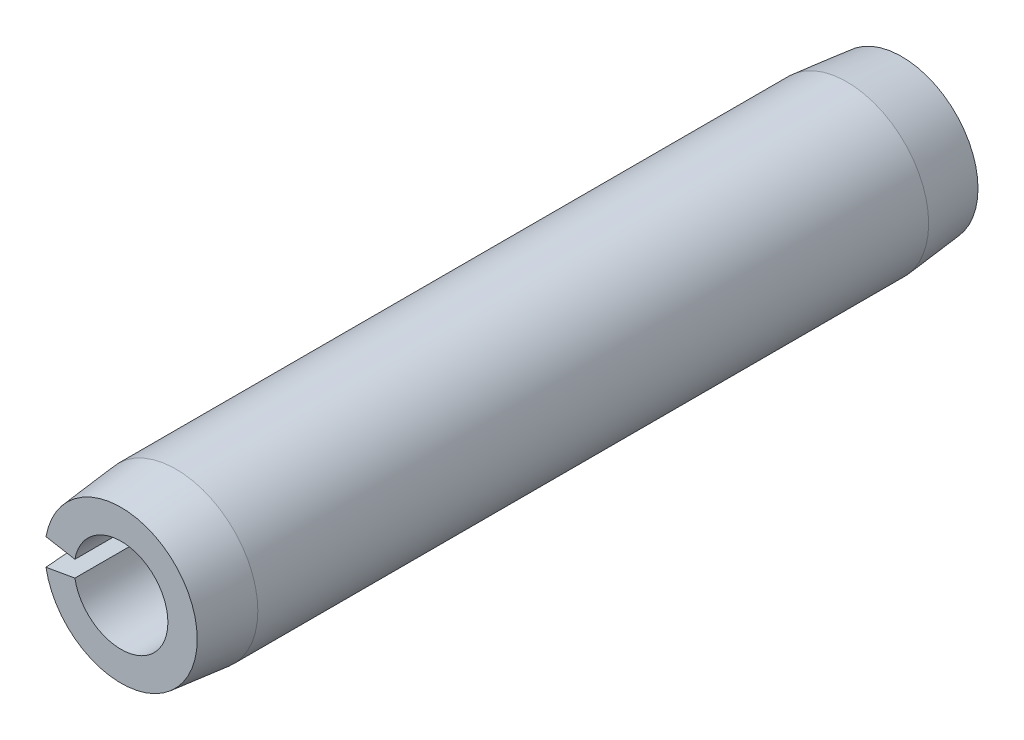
ISO-10303-21;
HEADER;
FILE_DESCRIPTION(('STEP AP214'),'2;1');
FILE_NAME('part.step','',(''),(''),'','','');
FILE_SCHEMA(('AUTOMOTIVE_DESIGN { 1 0 10303 214 1 1 1 1 }'));
ENDSEC;
DATA;
#1=APPLICATION_CONTEXT('core data for automotive mechanical design processes');
#2=APPLICATION_PROTOCOL_DEFINITION('international standard','automotive_design',2000,#1);
#3=PRODUCT_CONTEXT('',#1,'mechanical');
#4=PRODUCT('Part','Part','',(#3));
#5=PRODUCT_RELATED_PRODUCT_CATEGORY('part','',(#4));
#6=PRODUCT_DEFINITION_FORMATION('','',#4);
#7=PRODUCT_DEFINITION_CONTEXT('part definition',#1,'design');
#8=PRODUCT_DEFINITION('design','',#6,#7);
#9=PRODUCT_DEFINITION_SHAPE('','',#8);
#10=(LENGTH_UNIT() NAMED_UNIT(*) SI_UNIT(.MILLI.,.METRE.));
#11=(NAMED_UNIT(*) PLANE_ANGLE_UNIT() SI_UNIT($,.RADIAN.));
#12=(NAMED_UNIT(*) SI_UNIT($,.STERADIAN.) SOLID_ANGLE_UNIT());
#13=UNCERTAINTY_MEASURE_WITH_UNIT(LENGTH_MEASURE(1.E-05),#10,'distance_accuracy_value','');
#14=(GEOMETRIC_REPRESENTATION_CONTEXT(3) GLOBAL_UNCERTAINTY_ASSIGNED_CONTEXT((#13)) GLOBAL_UNIT_ASSIGNED_CONTEXT((#10,
#11,#12)) REPRESENTATION_CONTEXT('',''));
#15=CARTESIAN_POINT('',(0.,0.,0.));
#16=DIRECTION('',(0.,0.,1.));
#17=DIRECTION('',(1.,0.,0.));
#18=AXIS2_PLACEMENT_3D('',#15,#16,#17);
#19=CARTESIAN_POINT('',(0.,0.,7.9375));
#20=DIRECTION('',(0.,0.,-1.));
#21=DIRECTION('',(-1.,0.,0.));
#22=AXIS2_PLACEMENT_3D('',#19,#20,#21);
#23=CYLINDRICAL_SURFACE('',#22,0.9525);
#24=CARTESIAN_POINT('',(0.,0.,-7.9375));
#25=DIRECTION('',(0.,0.,-1.));
#26=DIRECTION('',(1.,0.,0.));
#27=AXIS2_PLACEMENT_3D('',#24,#25,#26);
#28=CIRCLE('',#27,0.9525);
#29=CARTESIAN_POINT('',(-0.938029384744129,0.165399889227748,-7.9375));
#30=VERTEX_POINT('',#29);
#31=CARTESIAN_POINT('',(-0.938029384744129,-0.165399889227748,-7.9375));
#32=VERTEX_POINT('',#31);
#33=EDGE_CURVE('E131',#30,#32,#28,.T.);
#34=ORIENTED_EDGE('',*,*,#33,.T.);
#35=DIRECTION('',(0.,0.,-1.));
#36=VECTOR('',#35,1.);
#37=CARTESIAN_POINT('',(-0.938029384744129,-0.165399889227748,7.9375));
#38=LINE('',#37,#36);
#39=CARTESIAN_POINT('',(-0.938029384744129,-0.165399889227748,7.9375));
#40=VERTEX_POINT('',#39);
#41=EDGE_CURVE('E11',#40,#32,#38,.T.);
#42=ORIENTED_EDGE('',*,*,#41,.F.);
#43=CARTESIAN_POINT('',(0.,0.,7.9375));
#44=DIRECTION('',(0.,0.,-1.));
#45=DIRECTION('',(1.,0.,0.));
#46=AXIS2_PLACEMENT_3D('',#43,#44,#45);
#47=CIRCLE('',#46,0.9525);
#48=CARTESIAN_POINT('',(-0.938029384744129,0.165399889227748,7.9375));
#49=VERTEX_POINT('',#48);
#50=EDGE_CURVE('E126',#49,#40,#47,.T.);
#51=ORIENTED_EDGE('',*,*,#50,.F.);
#52=DIRECTION('',(0.,0.,-1.));
#53=VECTOR('',#52,1.);
#54=CARTESIAN_POINT('',(-0.938029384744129,0.165399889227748,7.9375));
#55=LINE('',#54,#53);
#56=EDGE_CURVE('E115',#49,#30,#55,.T.);
#57=ORIENTED_EDGE('',*,*,#56,.T.);
#58=EDGE_LOOP('',(#34,#42,#51,#57));
#59=FACE_BOUND('',#58,.T.);
#60=ADVANCED_FACE('F39',(#59),#23,.F.);
#61=CARTESIAN_POINT('',(-0.938029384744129,-0.165399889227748,7.9375));
#62=DIRECTION('',(0.173648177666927,-0.984807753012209,0.));
#63=DIRECTION('',(0.984807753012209,0.173648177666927,0.));
#64=AXIS2_PLACEMENT_3D('',#61,#62,#63);
#65=PLANE('',#64);
#66=DIRECTION('',(0.,0.,-1.));
#67=VECTOR('',#66,1.);
#68=CARTESIAN_POINT('',(-1.63842465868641,-0.288898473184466,7.9375));
#69=LINE('',#68,#67);
#70=CARTESIAN_POINT('',(-1.63842465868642,-0.288898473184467,6.8199));
#71=VERTEX_POINT('',#70);
#72=CARTESIAN_POINT('',(-1.63842465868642,-0.288898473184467,-6.8199));
#73=VERTEX_POINT('',#72);
#74=EDGE_CURVE('E47',#71,#73,#69,.T.);
#75=ORIENTED_EDGE('',*,*,#74,.F.);
#76=DIRECTION('',(-0.100196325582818,-0.0176673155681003,-0.99481081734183));
#77=VECTOR('',#76,1.);
#78=CARTESIAN_POINT('',(0.,0.,23.0871888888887));
#79=LINE('',#78,#77);
#80=CARTESIAN_POINT('',(-1.52586113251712,-0.269050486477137,7.9375));
#81=VERTEX_POINT('',#80);
#82=EDGE_CURVE('E94',#71,#81,#79,.F.);
#83=ORIENTED_EDGE('',*,*,#82,.T.);
#84=DIRECTION('',(-0.984807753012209,-0.173648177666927,0.));
#85=VECTOR('',#84,1.);
#86=CARTESIAN_POINT('',(-0.938029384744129,-0.165399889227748,7.9375));
#87=LINE('',#86,#85);
#88=EDGE_CURVE('E137',#40,#81,#87,.T.);
#89=ORIENTED_EDGE('',*,*,#88,.F.);
#90=ORIENTED_EDGE('',*,*,#41,.T.);
#91=DIRECTION('',(-0.984807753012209,-0.173648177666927,0.));
#92=VECTOR('',#91,1.);
#93=CARTESIAN_POINT('',(-0.938029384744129,-0.165399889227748,-7.9375));
#94=LINE('',#93,#92);
#95=CARTESIAN_POINT('',(-1.52586113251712,-0.269050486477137,-7.9375));
#96=VERTEX_POINT('',#95);
#97=EDGE_CURVE('E127',#32,#96,#94,.T.);
#98=ORIENTED_EDGE('',*,*,#97,.T.);
#99=DIRECTION('',(0.100196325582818,0.0176673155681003,-0.99481081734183));
#100=VECTOR('',#99,1.);
#101=CARTESIAN_POINT('',(0.,0.,-23.0871888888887));
#102=LINE('',#101,#100);
#103=EDGE_CURVE('E62',#96,#73,#102,.F.);
#104=ORIENTED_EDGE('',*,*,#103,.T.);
#105=EDGE_LOOP('',(#75,#83,#89,#90,#98,#104));
#106=FACE_BOUND('',#105,.T.);
#107=ADVANCED_FACE('F158',(#106),#65,.F.);
#108=CARTESIAN_POINT('',(0.,0.,7.9375));
#109=DIRECTION('',(0.,0.,-1.));
#110=DIRECTION('',(-1.,0.,0.));
#111=AXIS2_PLACEMENT_3D('',#108,#109,#110);
#112=CYLINDRICAL_SURFACE('',#111,1.6637);
#113=DIRECTION('',(0.,0.,-1.));
#114=VECTOR('',#113,1.);
#115=CARTESIAN_POINT('',(-1.63842465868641,0.288898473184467,7.9375));
#116=LINE('',#115,#114);
#117=CARTESIAN_POINT('',(-1.63842465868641,0.288898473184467,6.8199));
#118=VERTEX_POINT('',#117);
#119=CARTESIAN_POINT('',(-1.63842465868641,0.288898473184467,-6.8199));
#120=VERTEX_POINT('',#119);
#121=EDGE_CURVE('E105',#118,#120,#116,.T.);
#122=ORIENTED_EDGE('',*,*,#121,.F.);
#123=CARTESIAN_POINT('',(0.,0.,6.8199));
#124=DIRECTION('',(0.,0.,-1.));
#125=DIRECTION('',(-1.,0.,0.));
#126=AXIS2_PLACEMENT_3D('',#123,#124,#125);
#127=CIRCLE('',#126,1.6637);
#128=EDGE_CURVE('E91',#118,#71,#127,.T.);
#129=ORIENTED_EDGE('',*,*,#128,.T.);
#130=ORIENTED_EDGE('',*,*,#74,.T.);
#131=CARTESIAN_POINT('',(0.,0.,-6.8199));
#132=DIRECTION('',(0.,0.,-1.));
#133=DIRECTION('',(-1.,0.,0.));
#134=AXIS2_PLACEMENT_3D('',#131,#132,#133);
#135=CIRCLE('',#134,1.6637);
#136=EDGE_CURVE('E113',#120,#73,#135,.T.);
#137=ORIENTED_EDGE('',*,*,#136,.F.);
#138=EDGE_LOOP('',(#122,#129,#130,#137));
#139=FACE_BOUND('',#138,.T.);
#140=ADVANCED_FACE('F112',(#139),#112,.T.);
#141=CARTESIAN_POINT('',(-1.63842465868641,0.288898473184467,7.9375));
#142=DIRECTION('',(0.173648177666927,0.984807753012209,0.));
#143=DIRECTION('',(-0.984807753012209,0.173648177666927,0.));
#144=AXIS2_PLACEMENT_3D('',#141,#142,#143);
#145=PLANE('',#144);
#146=DIRECTION('',(0.984807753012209,-0.173648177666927,0.));
#147=VECTOR('',#146,1.);
#148=CARTESIAN_POINT('',(-1.63842465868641,0.288898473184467,7.9375));
#149=LINE('',#148,#147);
#150=CARTESIAN_POINT('',(-1.52586113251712,0.269050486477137,7.9375));
#151=VERTEX_POINT('',#150);
#152=EDGE_CURVE('E108',#151,#49,#149,.T.);
#153=ORIENTED_EDGE('',*,*,#152,.F.);
#154=DIRECTION('',(0.100196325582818,-0.0176673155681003,0.99481081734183));
#155=VECTOR('',#154,1.);
#156=CARTESIAN_POINT('',(0.,0.,23.0871888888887));
#157=LINE('',#156,#155);
#158=EDGE_CURVE('E54',#151,#118,#157,.F.);
#159=ORIENTED_EDGE('',*,*,#158,.T.);
#160=ORIENTED_EDGE('',*,*,#121,.T.);
#161=DIRECTION('',(-0.100196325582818,0.0176673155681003,0.99481081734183));
#162=VECTOR('',#161,1.);
#163=CARTESIAN_POINT('',(0.,0.,-23.0871888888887));
#164=LINE('',#163,#162);
#165=CARTESIAN_POINT('',(-1.52586113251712,0.269050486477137,-7.9375));
#166=VERTEX_POINT('',#165);
#167=EDGE_CURVE('E145',#120,#166,#164,.F.);
#168=ORIENTED_EDGE('',*,*,#167,.T.);
#169=DIRECTION('',(0.984807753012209,-0.173648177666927,0.));
#170=VECTOR('',#169,1.);
#171=CARTESIAN_POINT('',(-1.63842465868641,0.288898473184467,-7.9375));
#172=LINE('',#171,#170);
#173=EDGE_CURVE('E123',#166,#30,#172,.T.);
#174=ORIENTED_EDGE('',*,*,#173,.T.);
#175=ORIENTED_EDGE('',*,*,#56,.F.);
#176=EDGE_LOOP('',(#153,#159,#160,#168,#174,#175));
#177=FACE_BOUND('',#176,.T.);
#178=ADVANCED_FACE('F103',(#177),#145,.F.);
#179=CARTESIAN_POINT('',(0.,0.,7.9375));
#180=DIRECTION('',(0.,0.,1.));
#181=DIRECTION('',(1.,0.,0.));
#182=AXIS2_PLACEMENT_3D('',#179,#180,#181);
#183=PLANE('',#182);
#184=CARTESIAN_POINT('',(0.,0.,7.9375));
#185=DIRECTION('',(0.,0.,-1.));
#186=DIRECTION('',(-1.,0.,0.));
#187=AXIS2_PLACEMENT_3D('',#184,#185,#186);
#188=CIRCLE('',#187,1.5494);
#189=EDGE_CURVE('E99',#151,#81,#188,.T.);
#190=ORIENTED_EDGE('',*,*,#189,.F.);
#191=ORIENTED_EDGE('',*,*,#152,.T.);
#192=ORIENTED_EDGE('',*,*,#50,.T.);
#193=ORIENTED_EDGE('',*,*,#88,.T.);
#194=EDGE_LOOP('',(#190,#191,#192,#193));
#195=FACE_BOUND('',#194,.T.);
#196=ADVANCED_FACE('F159',(#195),#183,.T.);
#197=CARTESIAN_POINT('',(0.,0.,-7.9375));
#198=DIRECTION('',(0.,0.,1.));
#199=DIRECTION('',(1.,0.,0.));
#200=AXIS2_PLACEMENT_3D('',#197,#198,#199);
#201=PLANE('',#200);
#202=ORIENTED_EDGE('',*,*,#173,.F.);
#203=CARTESIAN_POINT('',(0.,0.,-7.9375));
#204=DIRECTION('',(0.,0.,-1.));
#205=DIRECTION('',(-1.,0.,0.));
#206=AXIS2_PLACEMENT_3D('',#203,#204,#205);
#207=CIRCLE('',#206,1.5494);
#208=EDGE_CURVE('E148',#166,#96,#207,.T.);
#209=ORIENTED_EDGE('',*,*,#208,.T.);
#210=ORIENTED_EDGE('',*,*,#97,.F.);
#211=ORIENTED_EDGE('',*,*,#33,.F.);
#212=EDGE_LOOP('',(#202,#209,#210,#211));
#213=FACE_BOUND('',#212,.T.);
#214=ADVANCED_FACE('F166',(#213),#201,.F.);
#215=CARTESIAN_POINT('',(0.,0.,-6.8199));
#216=DIRECTION('',(0.,0.,1.));
#217=DIRECTION('',(1.,0.,0.));
#218=AXIS2_PLACEMENT_3D('',#215,#216,#217);
#219=CONICAL_SURFACE('',#218,1.6637,0.101918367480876);
#220=ORIENTED_EDGE('',*,*,#208,.F.);
#221=ORIENTED_EDGE('',*,*,#167,.F.);
#222=ORIENTED_EDGE('',*,*,#136,.T.);
#223=ORIENTED_EDGE('',*,*,#103,.F.);
#224=EDGE_LOOP('',(#220,#221,#222,#223));
#225=FACE_BOUND('',#224,.T.);
#226=ADVANCED_FACE('F167',(#225),#219,.T.);
#227=CARTESIAN_POINT('',(0.,0.,7.9375));
#228=DIRECTION('',(0.,0.,-1.));
#229=DIRECTION('',(-1.,0.,0.));
#230=AXIS2_PLACEMENT_3D('',#227,#228,#229);
#231=CONICAL_SURFACE('',#230,1.5494,0.101918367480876);
#232=ORIENTED_EDGE('',*,*,#128,.F.);
#233=ORIENTED_EDGE('',*,*,#158,.F.);
#234=ORIENTED_EDGE('',*,*,#189,.T.);
#235=ORIENTED_EDGE('',*,*,#82,.F.);
#236=EDGE_LOOP('',(#232,#233,#234,#235));
#237=FACE_BOUND('',#236,.T.);
#238=ADVANCED_FACE('F92',(#237),#231,.T.);
#239=CLOSED_SHELL('',(#60,#107,#140,#178,#196,#214,#226,#238));
#240=MANIFOLD_SOLID_BREP('B2',#239);
#241=ADVANCED_BREP_SHAPE_REPRESENTATION('',(#18,#240),#14);
#242=SHAPE_DEFINITION_REPRESENTATION(#9,#241);
ENDSEC;
END-ISO-10303-21;
